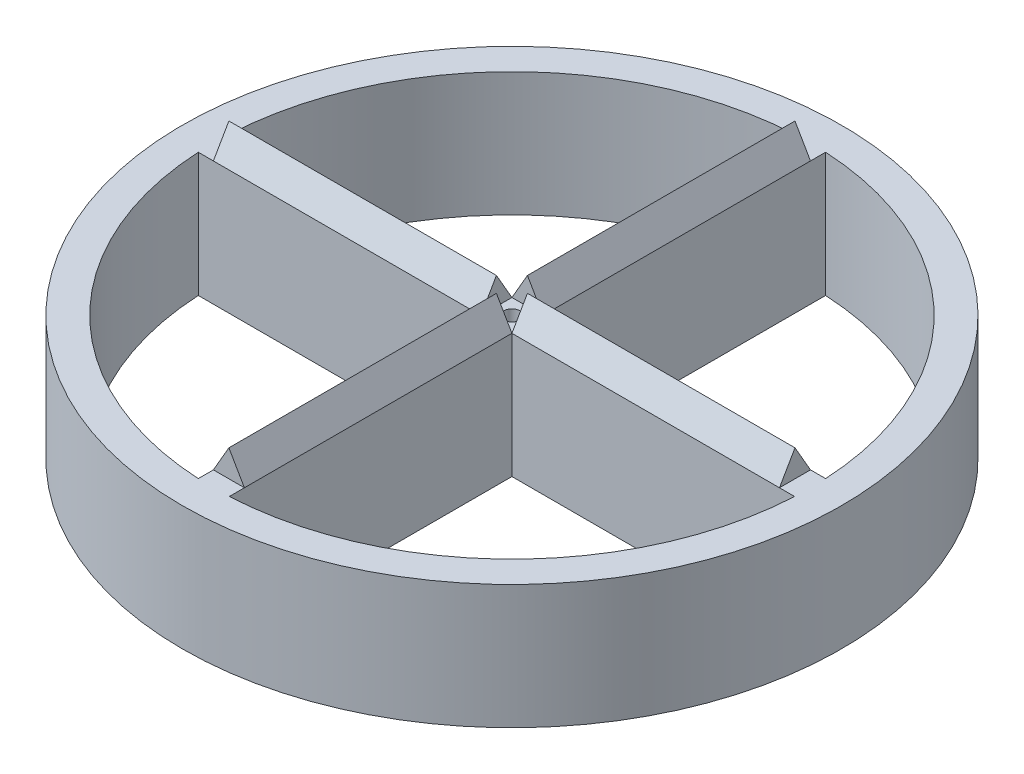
ISO-10303-21;
HEADER;
FILE_DESCRIPTION(('STEP AP214'),'2;1');
FILE_NAME('part.step','',(''),(''),'','','');
FILE_SCHEMA(('AUTOMOTIVE_DESIGN { 1 0 10303 214 1 1 1 1 }'));
ENDSEC;
DATA;
#1=APPLICATION_CONTEXT('core data for automotive mechanical design processes');
#2=APPLICATION_PROTOCOL_DEFINITION('international standard','automotive_design',2000,#1);
#3=PRODUCT_CONTEXT('',#1,'mechanical');
#4=PRODUCT('Part','Part','',(#3));
#5=PRODUCT_RELATED_PRODUCT_CATEGORY('part','',(#4));
#6=PRODUCT_DEFINITION_FORMATION('','',#4);
#7=PRODUCT_DEFINITION_CONTEXT('part definition',#1,'design');
#8=PRODUCT_DEFINITION('design','',#6,#7);
#9=PRODUCT_DEFINITION_SHAPE('','',#8);
#10=(LENGTH_UNIT() NAMED_UNIT(*) SI_UNIT(.MILLI.,.METRE.));
#11=(NAMED_UNIT(*) PLANE_ANGLE_UNIT() SI_UNIT($,.RADIAN.));
#12=(NAMED_UNIT(*) SI_UNIT($,.STERADIAN.) SOLID_ANGLE_UNIT());
#13=UNCERTAINTY_MEASURE_WITH_UNIT(LENGTH_MEASURE(1.E-05),#10,'distance_accuracy_value','');
#14=(GEOMETRIC_REPRESENTATION_CONTEXT(3) GLOBAL_UNCERTAINTY_ASSIGNED_CONTEXT((#13)) GLOBAL_UNIT_ASSIGNED_CONTEXT((#10,
#11,#12)) REPRESENTATION_CONTEXT('',''));
#15=CARTESIAN_POINT('',(0.,0.,0.));
#16=DIRECTION('',(0.,0.,1.));
#17=DIRECTION('',(1.,0.,0.));
#18=AXIS2_PLACEMENT_3D('',#15,#16,#17);
#19=CARTESIAN_POINT('',(-5.,40.,91.25));
#20=DIRECTION('',(-0.866025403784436,0.500000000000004,0.));
#21=DIRECTION('',(-0.500000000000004,-0.866025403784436,0.));
#22=AXIS2_PLACEMENT_3D('',#19,#20,#21);
#23=PLANE('',#22);
#24=DIRECTION('',(-0.500000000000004,-0.866025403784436,0.));
#25=VECTOR('',#24,1.);
#26=CARTESIAN_POINT('',(-5.,40.,-5.));
#27=LINE('',#26,#25);
#28=CARTESIAN_POINT('',(0.,48.6602540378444,-5.));
#29=VERTEX_POINT('',#28);
#30=CARTESIAN_POINT('',(-5.,40.,-5.));
#31=VERTEX_POINT('',#30);
#32=EDGE_CURVE('E176',#29,#31,#27,.T.);
#33=ORIENTED_EDGE('',*,*,#32,.F.);
#34=DIRECTION('',(0.,0.,-1.));
#35=VECTOR('',#34,1.);
#36=CARTESIAN_POINT('',(0.,48.6602540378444,91.25));
#37=LINE('',#36,#35);
#38=CARTESIAN_POINT('',(0.,48.6602540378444,-91.25));
#39=VERTEX_POINT('',#38);
#40=EDGE_CURVE('E200',#29,#39,#37,.T.);
#41=ORIENTED_EDGE('',*,*,#40,.T.);
#42=DIRECTION('',(0.500000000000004,0.866025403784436,0.));
#43=VECTOR('',#42,1.);
#44=CARTESIAN_POINT('',(-5.00000000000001,40.,-91.25));
#45=LINE('',#44,#43);
#46=CARTESIAN_POINT('',(-5.00000000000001,40.,-91.25));
#47=VERTEX_POINT('',#46);
#48=EDGE_CURVE('E352',#47,#39,#45,.T.);
#49=ORIENTED_EDGE('',*,*,#48,.F.);
#50=DIRECTION('',(0.,0.,-1.));
#51=VECTOR('',#50,1.);
#52=CARTESIAN_POINT('',(-5.,40.,-5.));
#53=LINE('',#52,#51);
#54=EDGE_CURVE('E390',#31,#47,#53,.T.);
#55=ORIENTED_EDGE('',*,*,#54,.F.);
#56=EDGE_LOOP('',(#33,#41,#49,#55));
#57=FACE_BOUND('',#56,.T.);
#58=ADVANCED_FACE('F33',(#57),#23,.T.);
#59=CARTESIAN_POINT('',(5.,40.,91.25));
#60=DIRECTION('',(0.86602540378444,0.499999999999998,0.));
#61=DIRECTION('',(-0.499999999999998,0.86602540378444,0.));
#62=AXIS2_PLACEMENT_3D('',#59,#60,#61);
#63=PLANE('',#62);
#64=DIRECTION('',(-0.499999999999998,0.86602540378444,0.));
#65=VECTOR('',#64,1.);
#66=CARTESIAN_POINT('',(4.99999999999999,40.,-5.));
#67=LINE('',#66,#65);
#68=CARTESIAN_POINT('',(5.,40.,-5.));
#69=VERTEX_POINT('',#68);
#70=EDGE_CURVE('E11',#69,#29,#67,.T.);
#71=ORIENTED_EDGE('',*,*,#70,.F.);
#72=DIRECTION('',(0.,0.,-1.));
#73=VECTOR('',#72,1.);
#74=CARTESIAN_POINT('',(5.,40.,91.25));
#75=LINE('',#74,#73);
#76=CARTESIAN_POINT('',(4.99999999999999,40.,-91.25));
#77=VERTEX_POINT('',#76);
#78=EDGE_CURVE('E198',#69,#77,#75,.T.);
#79=ORIENTED_EDGE('',*,*,#78,.T.);
#80=DIRECTION('',(0.499999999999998,-0.86602540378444,0.));
#81=VECTOR('',#80,1.);
#82=CARTESIAN_POINT('',(4.99999999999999,40.,-91.25));
#83=LINE('',#82,#81);
#84=EDGE_CURVE('E348',#39,#77,#83,.T.);
#85=ORIENTED_EDGE('',*,*,#84,.F.);
#86=ORIENTED_EDGE('',*,*,#40,.F.);
#87=EDGE_LOOP('',(#71,#79,#85,#86));
#88=FACE_BOUND('',#87,.T.);
#89=ADVANCED_FACE('F196',(#88),#63,.T.);
#90=CARTESIAN_POINT('',(91.25,40.,-5.));
#91=DIRECTION('',(0.,0.499999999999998,-0.86602540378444));
#92=DIRECTION('',(0.,0.86602540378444,0.499999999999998));
#93=AXIS2_PLACEMENT_3D('',#90,#91,#92);
#94=PLANE('',#93);
#95=DIRECTION('',(-1.,0.,0.));
#96=VECTOR('',#95,1.);
#97=CARTESIAN_POINT('',(91.25,48.6602540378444,0.));
#98=LINE('',#97,#96);
#99=CARTESIAN_POINT('',(-5.,48.6602540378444,0.));
#100=VERTEX_POINT('',#99);
#101=CARTESIAN_POINT('',(-91.25,48.6602540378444,0.));
#102=VERTEX_POINT('',#101);
#103=EDGE_CURVE('E380',#100,#102,#98,.T.);
#104=ORIENTED_EDGE('',*,*,#103,.F.);
#105=DIRECTION('',(0.,-0.86602540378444,-0.499999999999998));
#106=VECTOR('',#105,1.);
#107=CARTESIAN_POINT('',(-5.,40.,-5.));
#108=LINE('',#107,#106);
#109=EDGE_CURVE('E219',#100,#31,#108,.T.);
#110=ORIENTED_EDGE('',*,*,#109,.T.);
#111=DIRECTION('',(1.,0.,0.));
#112=VECTOR('',#111,1.);
#113=CARTESIAN_POINT('',(-5.,40.,-5.));
#114=LINE('',#113,#112);
#115=CARTESIAN_POINT('',(-91.25,40.,-5.));
#116=VERTEX_POINT('',#115);
#117=EDGE_CURVE('E385',#116,#31,#114,.T.);
#118=ORIENTED_EDGE('',*,*,#117,.F.);
#119=DIRECTION('',(0.,-0.86602540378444,-0.499999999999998));
#120=VECTOR('',#119,1.);
#121=CARTESIAN_POINT('',(-91.25,40.,-5.));
#122=LINE('',#121,#120);
#123=EDGE_CURVE('E365',#102,#116,#122,.T.);
#124=ORIENTED_EDGE('',*,*,#123,.F.);
#125=EDGE_LOOP('',(#104,#110,#118,#124));
#126=FACE_BOUND('',#125,.T.);
#127=ADVANCED_FACE('F416',(#126),#94,.T.);
#128=DIRECTION('',(1.,0.,0.));
#129=VECTOR('',#128,1.);
#130=CARTESIAN_POINT('',(5.,40.,-5.));
#131=LINE('',#130,#129);
#132=CARTESIAN_POINT('',(91.25,40.,-5.));
#133=VERTEX_POINT('',#132);
#134=EDGE_CURVE('E223',#69,#133,#131,.T.);
#135=ORIENTED_EDGE('',*,*,#134,.F.);
#136=DIRECTION('',(0.,0.86602540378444,0.499999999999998));
#137=VECTOR('',#136,1.);
#138=CARTESIAN_POINT('',(4.99999999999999,40.,-5.));
#139=LINE('',#138,#137);
#140=CARTESIAN_POINT('',(4.99999999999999,48.6602540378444,0.));
#141=VERTEX_POINT('',#140);
#142=EDGE_CURVE('E213',#69,#141,#139,.T.);
#143=ORIENTED_EDGE('',*,*,#142,.T.);
#144=CARTESIAN_POINT('',(91.25,48.6602540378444,0.));
#145=VERTEX_POINT('',#144);
#146=EDGE_CURVE('E378',#145,#141,#98,.T.);
#147=ORIENTED_EDGE('',*,*,#146,.F.);
#148=DIRECTION('',(0.,-0.86602540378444,-0.499999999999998));
#149=VECTOR('',#148,1.);
#150=CARTESIAN_POINT('',(91.25,40.,-5.));
#151=LINE('',#150,#149);
#152=EDGE_CURVE('E225',#145,#133,#151,.T.);
#153=ORIENTED_EDGE('',*,*,#152,.T.);
#154=EDGE_LOOP('',(#135,#143,#147,#153));
#155=FACE_BOUND('',#154,.T.);
#156=ADVANCED_FACE('F224',(#155),#94,.T.);
#157=CARTESIAN_POINT('',(91.25,40.,5.));
#158=DIRECTION('',(0.,0.500000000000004,0.866025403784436));
#159=DIRECTION('',(0.,-0.866025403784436,0.500000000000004));
#160=AXIS2_PLACEMENT_3D('',#157,#158,#159);
#161=PLANE('',#160);
#162=DIRECTION('',(-1.,0.,0.));
#163=VECTOR('',#162,1.);
#164=CARTESIAN_POINT('',(-5.,40.,5.));
#165=LINE('',#164,#163);
#166=CARTESIAN_POINT('',(-5.,40.,5.00000000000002));
#167=VERTEX_POINT('',#166);
#168=CARTESIAN_POINT('',(-91.25,40.,5.00000000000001));
#169=VERTEX_POINT('',#168);
#170=EDGE_CURVE('E251',#167,#169,#165,.T.);
#171=ORIENTED_EDGE('',*,*,#170,.F.);
#172=DIRECTION('',(0.,0.866025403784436,-0.500000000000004));
#173=VECTOR('',#172,1.);
#174=CARTESIAN_POINT('',(-5.,40.,5.00000000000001));
#175=LINE('',#174,#173);
#176=EDGE_CURVE('E276',#167,#100,#175,.T.);
#177=ORIENTED_EDGE('',*,*,#176,.T.);
#178=ORIENTED_EDGE('',*,*,#103,.T.);
#179=DIRECTION('',(0.,0.866025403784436,-0.500000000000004));
#180=VECTOR('',#179,1.);
#181=CARTESIAN_POINT('',(-91.25,40.,5.00000000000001));
#182=LINE('',#181,#180);
#183=EDGE_CURVE('E370',#169,#102,#182,.T.);
#184=ORIENTED_EDGE('',*,*,#183,.F.);
#185=EDGE_LOOP('',(#171,#177,#178,#184));
#186=FACE_BOUND('',#185,.T.);
#187=ADVANCED_FACE('F422',(#186),#161,.T.);
#188=ORIENTED_EDGE('',*,*,#146,.T.);
#189=DIRECTION('',(0.,-0.866025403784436,0.500000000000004));
#190=VECTOR('',#189,1.);
#191=CARTESIAN_POINT('',(4.99999999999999,40.,5.));
#192=LINE('',#191,#190);
#193=CARTESIAN_POINT('',(5.,40.,5.));
#194=VERTEX_POINT('',#193);
#195=EDGE_CURVE('E216',#141,#194,#192,.T.);
#196=ORIENTED_EDGE('',*,*,#195,.T.);
#197=DIRECTION('',(-1.,0.,0.));
#198=VECTOR('',#197,1.);
#199=CARTESIAN_POINT('',(91.25,40.,5.));
#200=LINE('',#199,#198);
#201=CARTESIAN_POINT('',(91.25,40.,5.));
#202=VERTEX_POINT('',#201);
#203=EDGE_CURVE('E377',#202,#194,#200,.T.);
#204=ORIENTED_EDGE('',*,*,#203,.F.);
#205=DIRECTION('',(0.,0.866025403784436,-0.500000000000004));
#206=VECTOR('',#205,1.);
#207=CARTESIAN_POINT('',(91.25,40.,5.));
#208=LINE('',#207,#206);
#209=EDGE_CURVE('E48',#202,#145,#208,.T.);
#210=ORIENTED_EDGE('',*,*,#209,.T.);
#211=EDGE_LOOP('',(#188,#196,#204,#210));
#212=FACE_BOUND('',#211,.T.);
#213=ADVANCED_FACE('F470',(#212),#161,.T.);
#214=CARTESIAN_POINT('',(0.,40.,0.));
#215=DIRECTION('',(0.,1.,0.));
#216=DIRECTION('',(0.,0.,1.));
#217=AXIS2_PLACEMENT_3D('',#214,#215,#216);
#218=PLANE('',#217);
#219=DIRECTION('',(-1.,0.,0.));
#220=VECTOR('',#219,1.);
#221=CARTESIAN_POINT('',(-5.,40.,91.25));
#222=LINE('',#221,#220);
#223=CARTESIAN_POINT('',(5.,40.,91.25));
#224=VERTEX_POINT('',#223);
#225=CARTESIAN_POINT('',(-5.,40.,91.25));
#226=VERTEX_POINT('',#225);
#227=EDGE_CURVE('E357',#224,#226,#222,.T.);
#228=ORIENTED_EDGE('',*,*,#227,.T.);
#229=DIRECTION('',(0.,0.,-1.));
#230=VECTOR('',#229,1.);
#231=CARTESIAN_POINT('',(-5.,40.,5.));
#232=LINE('',#231,#230);
#233=CARTESIAN_POINT('',(-5.,40.,96.1200421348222));
#234=VERTEX_POINT('',#233);
#235=EDGE_CURVE('E246',#234,#226,#232,.T.);
#236=ORIENTED_EDGE('',*,*,#235,.F.);
#237=CARTESIAN_POINT('',(0.,40.,0.));
#238=DIRECTION('',(0.,1.,0.));
#239=DIRECTION('',(0.,0.,1.));
#240=AXIS2_PLACEMENT_3D('',#237,#238,#239);
#241=CIRCLE('',#240,96.25);
#242=CARTESIAN_POINT('',(-96.1200421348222,40.,5.));
#243=VERTEX_POINT('',#242);
#244=EDGE_CURVE('E244',#243,#234,#241,.T.);
#245=ORIENTED_EDGE('',*,*,#244,.F.);
#246=EDGE_CURVE('E250',#169,#243,#165,.T.);
#247=ORIENTED_EDGE('',*,*,#246,.F.);
#248=DIRECTION('',(0.,0.,1.));
#249=VECTOR('',#248,1.);
#250=CARTESIAN_POINT('',(-91.25,40.,-5.));
#251=LINE('',#250,#249);
#252=EDGE_CURVE('E368',#116,#169,#251,.T.);
#253=ORIENTED_EDGE('',*,*,#252,.F.);
#254=CARTESIAN_POINT('',(-96.1200421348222,40.,-5.));
#255=VERTEX_POINT('',#254);
#256=EDGE_CURVE('E387',#255,#116,#114,.T.);
#257=ORIENTED_EDGE('',*,*,#256,.F.);
#258=CARTESIAN_POINT('',(0.,40.,0.));
#259=DIRECTION('',(0.,1.,0.));
#260=DIRECTION('',(0.,0.,1.));
#261=AXIS2_PLACEMENT_3D('',#258,#259,#260);
#262=CIRCLE('',#261,96.25);
#263=CARTESIAN_POINT('',(-5.,40.,-96.1200421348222));
#264=VERTEX_POINT('',#263);
#265=EDGE_CURVE('E383',#264,#255,#262,.T.);
#266=ORIENTED_EDGE('',*,*,#265,.F.);
#267=EDGE_CURVE('E342',#47,#264,#53,.T.);
#268=ORIENTED_EDGE('',*,*,#267,.F.);
#269=DIRECTION('',(-1.,0.,0.));
#270=VECTOR('',#269,1.);
#271=CARTESIAN_POINT('',(-5.00000000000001,40.,-91.25));
#272=LINE('',#271,#270);
#273=EDGE_CURVE('E340',#77,#47,#272,.T.);
#274=ORIENTED_EDGE('',*,*,#273,.F.);
#275=DIRECTION('',(0.,0.,1.));
#276=VECTOR('',#275,1.);
#277=CARTESIAN_POINT('',(5.,40.,-5.));
#278=LINE('',#277,#276);
#279=CARTESIAN_POINT('',(5.,40.,-96.1200421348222));
#280=VERTEX_POINT('',#279);
#281=EDGE_CURVE('E209',#280,#77,#278,.T.);
#282=ORIENTED_EDGE('',*,*,#281,.F.);
#283=CARTESIAN_POINT('',(0.,40.,0.));
#284=DIRECTION('',(0.,1.,0.));
#285=DIRECTION('',(0.,0.,1.));
#286=AXIS2_PLACEMENT_3D('',#283,#284,#285);
#287=CIRCLE('',#286,96.25);
#288=CARTESIAN_POINT('',(96.1200421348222,40.,-5.));
#289=VERTEX_POINT('',#288);
#290=EDGE_CURVE('E320',#289,#280,#287,.T.);
#291=ORIENTED_EDGE('',*,*,#290,.F.);
#292=EDGE_CURVE('E229',#133,#289,#131,.T.);
#293=ORIENTED_EDGE('',*,*,#292,.F.);
#294=DIRECTION('',(0.,0.,1.));
#295=VECTOR('',#294,1.);
#296=CARTESIAN_POINT('',(91.25,40.,-5.));
#297=LINE('',#296,#295);
#298=EDGE_CURVE('E374',#133,#202,#297,.T.);
#299=ORIENTED_EDGE('',*,*,#298,.T.);
#300=DIRECTION('',(-1.,0.,0.));
#301=VECTOR('',#300,1.);
#302=CARTESIAN_POINT('',(5.,40.,5.));
#303=LINE('',#302,#301);
#304=CARTESIAN_POINT('',(96.1200421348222,40.,5.));
#305=VERTEX_POINT('',#304);
#306=EDGE_CURVE('E298',#305,#202,#303,.T.);
#307=ORIENTED_EDGE('',*,*,#306,.F.);
#308=CARTESIAN_POINT('',(0.,40.,0.));
#309=DIRECTION('',(0.,1.,0.));
#310=DIRECTION('',(0.,0.,1.));
#311=AXIS2_PLACEMENT_3D('',#308,#309,#310);
#312=CIRCLE('',#311,96.25);
#313=CARTESIAN_POINT('',(5.,40.,96.1200421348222));
#314=VERTEX_POINT('',#313);
#315=EDGE_CURVE('E293',#314,#305,#312,.T.);
#316=ORIENTED_EDGE('',*,*,#315,.F.);
#317=DIRECTION('',(0.,0.,1.));
#318=VECTOR('',#317,1.);
#319=CARTESIAN_POINT('',(5.,40.,5.));
#320=LINE('',#319,#318);
#321=EDGE_CURVE('E294',#224,#314,#320,.T.);
#322=ORIENTED_EDGE('',*,*,#321,.F.);
#323=EDGE_LOOP('',(#228,#236,#245,#247,#253,#257,#266,#268,#274,#282,#291,#293,#299,#307,#316,#322));
#324=FACE_BOUND('',#323,.T.);
#325=CARTESIAN_POINT('',(0.,40.,0.));
#326=DIRECTION('',(0.,1.,0.));
#327=DIRECTION('',(0.,0.,1.));
#328=AXIS2_PLACEMENT_3D('',#325,#326,#327);
#329=CIRCLE('',#328,106.25);
#330=CARTESIAN_POINT('',(0.,40.,106.25));
#331=VERTEX_POINT('',#330);
#332=EDGE_CURVE('E270',#331,#331,#329,.T.);
#333=ORIENTED_EDGE('',*,*,#332,.T.);
#334=EDGE_LOOP('',(#333));
#335=FACE_BOUND('',#334,.T.);
#336=ADVANCED_FACE('F335',(#324,#335),#218,.T.);
#337=CARTESIAN_POINT('',(0.,0.,0.));
#338=DIRECTION('',(0.,1.,0.));
#339=DIRECTION('',(0.,0.,1.));
#340=AXIS2_PLACEMENT_3D('',#337,#338,#339);
#341=PLANE('',#340);
#342=CARTESIAN_POINT('',(0.,0.,0.));
#343=DIRECTION('',(0.,1.,0.));
#344=DIRECTION('',(0.,0.,1.));
#345=AXIS2_PLACEMENT_3D('',#342,#343,#344);
#346=CIRCLE('',#345,2.6);
#347=CARTESIAN_POINT('',(0.,0.,2.6));
#348=VERTEX_POINT('',#347);
#349=EDGE_CURVE('E514',#348,#348,#346,.T.);
#350=ORIENTED_EDGE('',*,*,#349,.T.);
#351=EDGE_LOOP('',(#350));
#352=FACE_BOUND('',#351,.T.);
#353=DIRECTION('',(-1.,0.,0.));
#354=VECTOR('',#353,1.);
#355=CARTESIAN_POINT('',(5.,0.,5.));
#356=LINE('',#355,#354);
#357=CARTESIAN_POINT('',(96.1200421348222,0.,5.));
#358=VERTEX_POINT('',#357);
#359=CARTESIAN_POINT('',(5.,0.,5.));
#360=VERTEX_POINT('',#359);
#361=EDGE_CURVE('E302',#358,#360,#356,.T.);
#362=ORIENTED_EDGE('',*,*,#361,.T.);
#363=DIRECTION('',(0.,0.,1.));
#364=VECTOR('',#363,1.);
#365=CARTESIAN_POINT('',(5.,0.,5.));
#366=LINE('',#365,#364);
#367=CARTESIAN_POINT('',(5.,0.,96.1200421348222));
#368=VERTEX_POINT('',#367);
#369=EDGE_CURVE('E305',#360,#368,#366,.T.);
#370=ORIENTED_EDGE('',*,*,#369,.T.);
#371=CARTESIAN_POINT('',(0.,0.,0.));
#372=DIRECTION('',(0.,1.,0.));
#373=DIRECTION('',(0.,0.,1.));
#374=AXIS2_PLACEMENT_3D('',#371,#372,#373);
#375=CIRCLE('',#374,96.25);
#376=EDGE_CURVE('E309',#368,#358,#375,.T.);
#377=ORIENTED_EDGE('',*,*,#376,.T.);
#378=EDGE_LOOP('',(#362,#370,#377));
#379=FACE_BOUND('',#378,.T.);
#380=CARTESIAN_POINT('',(0.,0.,0.));
#381=DIRECTION('',(0.,1.,0.));
#382=DIRECTION('',(0.,0.,1.));
#383=AXIS2_PLACEMENT_3D('',#380,#381,#382);
#384=CIRCLE('',#383,96.25);
#385=CARTESIAN_POINT('',(-96.1200421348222,0.,5.));
#386=VERTEX_POINT('',#385);
#387=CARTESIAN_POINT('',(-5.,0.,96.1200421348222));
#388=VERTEX_POINT('',#387);
#389=EDGE_CURVE('E239',#386,#388,#384,.T.);
#390=ORIENTED_EDGE('',*,*,#389,.T.);
#391=DIRECTION('',(0.,0.,-1.));
#392=VECTOR('',#391,1.);
#393=CARTESIAN_POINT('',(-5.,0.,5.));
#394=LINE('',#393,#392);
#395=CARTESIAN_POINT('',(-5.,0.,5.));
#396=VERTEX_POINT('',#395);
#397=EDGE_CURVE('E257',#388,#396,#394,.T.);
#398=ORIENTED_EDGE('',*,*,#397,.T.);
#399=DIRECTION('',(-1.,0.,0.));
#400=VECTOR('',#399,1.);
#401=CARTESIAN_POINT('',(-5.,0.,5.));
#402=LINE('',#401,#400);
#403=EDGE_CURVE('E247',#396,#386,#402,.T.);
#404=ORIENTED_EDGE('',*,*,#403,.T.);
#405=EDGE_LOOP('',(#390,#398,#404));
#406=FACE_BOUND('',#405,.T.);
#407=CARTESIAN_POINT('',(0.,0.,0.));
#408=DIRECTION('',(0.,1.,0.));
#409=DIRECTION('',(0.,0.,1.));
#410=AXIS2_PLACEMENT_3D('',#407,#408,#409);
#411=CIRCLE('',#410,106.25);
#412=CARTESIAN_POINT('',(0.,0.,106.25));
#413=VERTEX_POINT('',#412);
#414=EDGE_CURVE('E269',#413,#413,#411,.T.);
#415=ORIENTED_EDGE('',*,*,#414,.F.);
#416=EDGE_LOOP('',(#415));
#417=FACE_BOUND('',#416,.T.);
#418=CARTESIAN_POINT('',(0.,0.,0.));
#419=DIRECTION('',(0.,1.,0.));
#420=DIRECTION('',(0.,0.,1.));
#421=AXIS2_PLACEMENT_3D('',#418,#419,#420);
#422=CIRCLE('',#421,96.25);
#423=CARTESIAN_POINT('',(96.1200421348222,0.,-5.));
#424=VERTEX_POINT('',#423);
#425=CARTESIAN_POINT('',(5.,0.,-96.1200421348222));
#426=VERTEX_POINT('',#425);
#427=EDGE_CURVE('E319',#424,#426,#422,.T.);
#428=ORIENTED_EDGE('',*,*,#427,.T.);
#429=DIRECTION('',(0.,0.,1.));
#430=VECTOR('',#429,1.);
#431=CARTESIAN_POINT('',(5.,0.,-5.));
#432=LINE('',#431,#430);
#433=CARTESIAN_POINT('',(5.,0.,-5.));
#434=VERTEX_POINT('',#433);
#435=EDGE_CURVE('E325',#426,#434,#432,.T.);
#436=ORIENTED_EDGE('',*,*,#435,.T.);
#437=DIRECTION('',(1.,0.,0.));
#438=VECTOR('',#437,1.);
#439=CARTESIAN_POINT('',(5.,0.,-5.));
#440=LINE('',#439,#438);
#441=EDGE_CURVE('E234',#434,#424,#440,.T.);
#442=ORIENTED_EDGE('',*,*,#441,.T.);
#443=EDGE_LOOP('',(#428,#436,#442));
#444=FACE_BOUND('',#443,.T.);
#445=CARTESIAN_POINT('',(0.,0.,0.));
#446=DIRECTION('',(0.,1.,0.));
#447=DIRECTION('',(0.,0.,1.));
#448=AXIS2_PLACEMENT_3D('',#445,#446,#447);
#449=CIRCLE('',#448,96.25);
#450=CARTESIAN_POINT('',(-5.,0.,-96.1200421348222));
#451=VERTEX_POINT('',#450);
#452=CARTESIAN_POINT('',(-96.1200421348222,0.,-5.));
#453=VERTEX_POINT('',#452);
#454=EDGE_CURVE('E56',#451,#453,#449,.T.);
#455=ORIENTED_EDGE('',*,*,#454,.T.);
#456=DIRECTION('',(1.,0.,0.));
#457=VECTOR('',#456,1.);
#458=CARTESIAN_POINT('',(-5.,0.,-5.));
#459=LINE('',#458,#457);
#460=CARTESIAN_POINT('',(-5.,0.,-5.));
#461=VERTEX_POINT('',#460);
#462=EDGE_CURVE('E394',#453,#461,#459,.T.);
#463=ORIENTED_EDGE('',*,*,#462,.T.);
#464=DIRECTION('',(0.,0.,-1.));
#465=VECTOR('',#464,1.);
#466=CARTESIAN_POINT('',(-5.,0.,-5.));
#467=LINE('',#466,#465);
#468=EDGE_CURVE('E386',#461,#451,#467,.T.);
#469=ORIENTED_EDGE('',*,*,#468,.T.);
#470=EDGE_LOOP('',(#455,#463,#469));
#471=FACE_BOUND('',#470,.T.);
#472=ADVANCED_FACE('F327',(#352,#379,#406,#417,#444,#471),#341,.F.);
#473=CARTESIAN_POINT('',(0.,40.,0.));
#474=DIRECTION('',(0.,-1.,0.));
#475=DIRECTION('',(0.,0.,-1.));
#476=AXIS2_PLACEMENT_3D('',#473,#474,#475);
#477=CYLINDRICAL_SURFACE('',#476,106.25);
#478=ORIENTED_EDGE('',*,*,#332,.F.);
#479=EDGE_LOOP('',(#478));
#480=FACE_BOUND('',#479,.T.);
#481=ORIENTED_EDGE('',*,*,#414,.T.);
#482=EDGE_LOOP('',(#481));
#483=FACE_BOUND('',#482,.T.);
#484=ADVANCED_FACE('F35',(#480,#483),#477,.T.);
#485=CARTESIAN_POINT('',(0.,40.,0.));
#486=DIRECTION('',(0.,-1.,0.));
#487=DIRECTION('',(0.,0.,-1.));
#488=AXIS2_PLACEMENT_3D('',#485,#486,#487);
#489=CYLINDRICAL_SURFACE('',#488,96.25);
#490=ORIENTED_EDGE('',*,*,#389,.F.);
#491=DIRECTION('',(0.,-1.,0.));
#492=VECTOR('',#491,1.);
#493=CARTESIAN_POINT('',(-96.1200421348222,40.,5.));
#494=LINE('',#493,#492);
#495=EDGE_CURVE('E254',#243,#386,#494,.T.);
#496=ORIENTED_EDGE('',*,*,#495,.F.);
#497=ORIENTED_EDGE('',*,*,#244,.T.);
#498=DIRECTION('',(0.,-1.,0.));
#499=VECTOR('',#498,1.);
#500=CARTESIAN_POINT('',(-5.,40.,96.1200421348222));
#501=LINE('',#500,#499);
#502=EDGE_CURVE('E266',#234,#388,#501,.T.);
#503=ORIENTED_EDGE('',*,*,#502,.T.);
#504=EDGE_LOOP('',(#490,#496,#497,#503));
#505=FACE_BOUND('',#504,.T.);
#506=ADVANCED_FACE('F500',(#505),#489,.F.);
#507=CARTESIAN_POINT('',(-5.,40.,5.));
#508=DIRECTION('',(-1.,0.,0.));
#509=DIRECTION('',(0.,0.,1.));
#510=AXIS2_PLACEMENT_3D('',#507,#508,#509);
#511=PLANE('',#510);
#512=ORIENTED_EDGE('',*,*,#397,.F.);
#513=ORIENTED_EDGE('',*,*,#502,.F.);
#514=ORIENTED_EDGE('',*,*,#235,.T.);
#515=DIRECTION('',(0.,0.,-1.));
#516=VECTOR('',#515,1.);
#517=CARTESIAN_POINT('',(-5.,40.,91.25));
#518=LINE('',#517,#516);
#519=EDGE_CURVE('E191',#226,#167,#518,.T.);
#520=ORIENTED_EDGE('',*,*,#519,.T.);
#521=DIRECTION('',(0.,-1.,0.));
#522=VECTOR('',#521,1.);
#523=CARTESIAN_POINT('',(-5.,40.,5.));
#524=LINE('',#523,#522);
#525=EDGE_CURVE('E264',#167,#396,#524,.T.);
#526=ORIENTED_EDGE('',*,*,#525,.T.);
#527=EDGE_LOOP('',(#512,#513,#514,#520,#526));
#528=FACE_BOUND('',#527,.T.);
#529=ADVANCED_FACE('F431',(#528),#511,.T.);
#530=CARTESIAN_POINT('',(-5.,40.,5.));
#531=DIRECTION('',(0.,0.,1.));
#532=DIRECTION('',(1.,0.,0.));
#533=AXIS2_PLACEMENT_3D('',#530,#531,#532);
#534=PLANE('',#533);
#535=ORIENTED_EDGE('',*,*,#403,.F.);
#536=ORIENTED_EDGE('',*,*,#525,.F.);
#537=ORIENTED_EDGE('',*,*,#170,.T.);
#538=ORIENTED_EDGE('',*,*,#246,.T.);
#539=ORIENTED_EDGE('',*,*,#495,.T.);
#540=EDGE_LOOP('',(#535,#536,#537,#538,#539));
#541=FACE_BOUND('',#540,.T.);
#542=ADVANCED_FACE('F429',(#541),#534,.T.);
#543=CARTESIAN_POINT('',(0.,40.,0.));
#544=DIRECTION('',(0.,-1.,0.));
#545=DIRECTION('',(0.,0.,-1.));
#546=AXIS2_PLACEMENT_3D('',#543,#544,#545);
#547=CYLINDRICAL_SURFACE('',#546,96.25);
#548=ORIENTED_EDGE('',*,*,#427,.F.);
#549=DIRECTION('',(0.,-1.,0.));
#550=VECTOR('',#549,1.);
#551=CARTESIAN_POINT('',(96.1200421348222,40.,-5.));
#552=LINE('',#551,#550);
#553=EDGE_CURVE('E228',#289,#424,#552,.T.);
#554=ORIENTED_EDGE('',*,*,#553,.F.);
#555=ORIENTED_EDGE('',*,*,#290,.T.);
#556=DIRECTION('',(0.,-1.,0.));
#557=VECTOR('',#556,1.);
#558=CARTESIAN_POINT('',(5.,40.,-96.1200421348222));
#559=LINE('',#558,#557);
#560=EDGE_CURVE('E236',#280,#426,#559,.T.);
#561=ORIENTED_EDGE('',*,*,#560,.T.);
#562=EDGE_LOOP('',(#548,#554,#555,#561));
#563=FACE_BOUND('',#562,.T.);
#564=ADVANCED_FACE('F330',(#563),#547,.F.);
#565=CARTESIAN_POINT('',(5.,40.,-5.));
#566=DIRECTION('',(1.,0.,0.));
#567=DIRECTION('',(0.,0.,-1.));
#568=AXIS2_PLACEMENT_3D('',#565,#566,#567);
#569=PLANE('',#568);
#570=ORIENTED_EDGE('',*,*,#435,.F.);
#571=ORIENTED_EDGE('',*,*,#560,.F.);
#572=ORIENTED_EDGE('',*,*,#281,.T.);
#573=ORIENTED_EDGE('',*,*,#78,.F.);
#574=DIRECTION('',(0.,-1.,0.));
#575=VECTOR('',#574,1.);
#576=CARTESIAN_POINT('',(5.,40.,-5.));
#577=LINE('',#576,#575);
#578=EDGE_CURVE('E205',#69,#434,#577,.T.);
#579=ORIENTED_EDGE('',*,*,#578,.T.);
#580=EDGE_LOOP('',(#570,#571,#572,#573,#579));
#581=FACE_BOUND('',#580,.T.);
#582=ADVANCED_FACE('F203',(#581),#569,.T.);
#583=CARTESIAN_POINT('',(5.,40.,-5.));
#584=DIRECTION('',(0.,0.,-1.));
#585=DIRECTION('',(-1.,0.,0.));
#586=AXIS2_PLACEMENT_3D('',#583,#584,#585);
#587=PLANE('',#586);
#588=ORIENTED_EDGE('',*,*,#441,.F.);
#589=ORIENTED_EDGE('',*,*,#578,.F.);
#590=ORIENTED_EDGE('',*,*,#134,.T.);
#591=ORIENTED_EDGE('',*,*,#292,.T.);
#592=ORIENTED_EDGE('',*,*,#553,.T.);
#593=EDGE_LOOP('',(#588,#589,#590,#591,#592));
#594=FACE_BOUND('',#593,.T.);
#595=ADVANCED_FACE('F231',(#594),#587,.T.);
#596=CARTESIAN_POINT('',(5.,40.,5.));
#597=DIRECTION('',(0.,0.,1.));
#598=DIRECTION('',(1.,0.,0.));
#599=AXIS2_PLACEMENT_3D('',#596,#597,#598);
#600=PLANE('',#599);
#601=ORIENTED_EDGE('',*,*,#361,.F.);
#602=DIRECTION('',(0.,-1.,0.));
#603=VECTOR('',#602,1.);
#604=CARTESIAN_POINT('',(96.1200421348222,40.,5.));
#605=LINE('',#604,#603);
#606=EDGE_CURVE('E296',#305,#358,#605,.T.);
#607=ORIENTED_EDGE('',*,*,#606,.F.);
#608=ORIENTED_EDGE('',*,*,#306,.T.);
#609=ORIENTED_EDGE('',*,*,#203,.T.);
#610=DIRECTION('',(0.,-1.,0.));
#611=VECTOR('',#610,1.);
#612=CARTESIAN_POINT('',(5.,40.,5.));
#613=LINE('',#612,#611);
#614=EDGE_CURVE('E316',#194,#360,#613,.T.);
#615=ORIENTED_EDGE('',*,*,#614,.T.);
#616=EDGE_LOOP('',(#601,#607,#608,#609,#615));
#617=FACE_BOUND('',#616,.T.);
#618=ADVANCED_FACE('F486',(#617),#600,.T.);
#619=CARTESIAN_POINT('',(5.,40.,5.));
#620=DIRECTION('',(1.,0.,0.));
#621=DIRECTION('',(0.,0.,-1.));
#622=AXIS2_PLACEMENT_3D('',#619,#620,#621);
#623=PLANE('',#622);
#624=ORIENTED_EDGE('',*,*,#369,.F.);
#625=ORIENTED_EDGE('',*,*,#614,.F.);
#626=EDGE_CURVE('E286',#194,#224,#320,.T.);
#627=ORIENTED_EDGE('',*,*,#626,.T.);
#628=ORIENTED_EDGE('',*,*,#321,.T.);
#629=DIRECTION('',(0.,-1.,0.));
#630=VECTOR('',#629,1.);
#631=CARTESIAN_POINT('',(5.,40.,96.1200421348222));
#632=LINE('',#631,#630);
#633=EDGE_CURVE('E314',#314,#368,#632,.T.);
#634=ORIENTED_EDGE('',*,*,#633,.T.);
#635=EDGE_LOOP('',(#624,#625,#627,#628,#634));
#636=FACE_BOUND('',#635,.T.);
#637=ADVANCED_FACE('F482',(#636),#623,.T.);
#638=CARTESIAN_POINT('',(0.,40.,0.));
#639=DIRECTION('',(0.,-1.,0.));
#640=DIRECTION('',(0.,0.,-1.));
#641=AXIS2_PLACEMENT_3D('',#638,#639,#640);
#642=CYLINDRICAL_SURFACE('',#641,96.25);
#643=ORIENTED_EDGE('',*,*,#376,.F.);
#644=ORIENTED_EDGE('',*,*,#633,.F.);
#645=ORIENTED_EDGE('',*,*,#315,.T.);
#646=ORIENTED_EDGE('',*,*,#606,.T.);
#647=EDGE_LOOP('',(#643,#644,#645,#646));
#648=FACE_BOUND('',#647,.T.);
#649=ADVANCED_FACE('F479',(#648),#642,.F.);
#650=CARTESIAN_POINT('',(0.,40.,0.));
#651=DIRECTION('',(0.,-1.,0.));
#652=DIRECTION('',(0.,0.,-1.));
#653=AXIS2_PLACEMENT_3D('',#650,#651,#652);
#654=CYLINDRICAL_SURFACE('',#653,96.25);
#655=ORIENTED_EDGE('',*,*,#454,.F.);
#656=DIRECTION('',(0.,-1.,0.));
#657=VECTOR('',#656,1.);
#658=CARTESIAN_POINT('',(-5.,40.,-96.1200421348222));
#659=LINE('',#658,#657);
#660=EDGE_CURVE('E392',#264,#451,#659,.T.);
#661=ORIENTED_EDGE('',*,*,#660,.F.);
#662=ORIENTED_EDGE('',*,*,#265,.T.);
#663=DIRECTION('',(0.,-1.,0.));
#664=VECTOR('',#663,1.);
#665=CARTESIAN_POINT('',(-96.1200421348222,40.,-5.));
#666=LINE('',#665,#664);
#667=EDGE_CURVE('E306',#255,#453,#666,.T.);
#668=ORIENTED_EDGE('',*,*,#667,.T.);
#669=EDGE_LOOP('',(#655,#661,#662,#668));
#670=FACE_BOUND('',#669,.T.);
#671=ADVANCED_FACE('F402',(#670),#654,.F.);
#672=CARTESIAN_POINT('',(-5.,40.,-5.));
#673=DIRECTION('',(0.,0.,-1.));
#674=DIRECTION('',(-1.,0.,0.));
#675=AXIS2_PLACEMENT_3D('',#672,#673,#674);
#676=PLANE('',#675);
#677=ORIENTED_EDGE('',*,*,#462,.F.);
#678=ORIENTED_EDGE('',*,*,#667,.F.);
#679=ORIENTED_EDGE('',*,*,#256,.T.);
#680=ORIENTED_EDGE('',*,*,#117,.T.);
#681=DIRECTION('',(0.,-1.,0.));
#682=VECTOR('',#681,1.);
#683=CARTESIAN_POINT('',(-5.,40.,-5.));
#684=LINE('',#683,#682);
#685=EDGE_CURVE('E400',#31,#461,#684,.T.);
#686=ORIENTED_EDGE('',*,*,#685,.T.);
#687=EDGE_LOOP('',(#677,#678,#679,#680,#686));
#688=FACE_BOUND('',#687,.T.);
#689=ADVANCED_FACE('F412',(#688),#676,.T.);
#690=CARTESIAN_POINT('',(-5.,40.,-5.));
#691=DIRECTION('',(-1.,0.,0.));
#692=DIRECTION('',(0.,0.,1.));
#693=AXIS2_PLACEMENT_3D('',#690,#691,#692);
#694=PLANE('',#693);
#695=ORIENTED_EDGE('',*,*,#468,.F.);
#696=ORIENTED_EDGE('',*,*,#685,.F.);
#697=ORIENTED_EDGE('',*,*,#54,.T.);
#698=ORIENTED_EDGE('',*,*,#267,.T.);
#699=ORIENTED_EDGE('',*,*,#660,.T.);
#700=EDGE_LOOP('',(#695,#696,#697,#698,#699));
#701=FACE_BOUND('',#700,.T.);
#702=ADVANCED_FACE('F408',(#701),#694,.T.);
#703=CARTESIAN_POINT('',(91.25,0.,0.));
#704=DIRECTION('',(-1.,0.,0.));
#705=DIRECTION('',(0.,0.,1.));
#706=AXIS2_PLACEMENT_3D('',#703,#704,#705);
#707=PLANE('',#706);
#708=ORIENTED_EDGE('',*,*,#152,.F.);
#709=ORIENTED_EDGE('',*,*,#209,.F.);
#710=ORIENTED_EDGE('',*,*,#298,.F.);
#711=EDGE_LOOP('',(#708,#709,#710));
#712=FACE_BOUND('',#711,.T.);
#713=ADVANCED_FACE('F465',(#712),#707,.F.);
#714=CARTESIAN_POINT('',(-91.25,0.,0.));
#715=DIRECTION('',(-1.,0.,0.));
#716=DIRECTION('',(0.,0.,1.));
#717=AXIS2_PLACEMENT_3D('',#714,#715,#716);
#718=PLANE('',#717);
#719=ORIENTED_EDGE('',*,*,#123,.T.);
#720=ORIENTED_EDGE('',*,*,#252,.T.);
#721=ORIENTED_EDGE('',*,*,#183,.T.);
#722=EDGE_LOOP('',(#719,#720,#721));
#723=FACE_BOUND('',#722,.T.);
#724=ADVANCED_FACE('F418',(#723),#718,.T.);
#725=CARTESIAN_POINT('',(-5.00000000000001,57.6602089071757,-101.25));
#726=DIRECTION('',(1.,0.,0.));
#727=DIRECTION('',(0.,0.,-1.));
#728=AXIS2_PLACEMENT_3D('',#725,#726,#727);
#729=PLANE('',#728);
#730=ORIENTED_EDGE('',*,*,#176,.F.);
#731=DIRECTION('',(0.,0.,1.));
#732=VECTOR('',#731,1.);
#733=CARTESIAN_POINT('',(-5.00000000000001,40.,-101.25));
#734=LINE('',#733,#732);
#735=EDGE_CURVE('E190',#31,#167,#734,.T.);
#736=ORIENTED_EDGE('',*,*,#735,.F.);
#737=ORIENTED_EDGE('',*,*,#109,.F.);
#738=EDGE_LOOP('',(#730,#736,#737));
#739=FACE_BOUND('',#738,.T.);
#740=ADVANCED_FACE('F438',(#739),#729,.T.);
#741=CARTESIAN_POINT('',(4.99999999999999,57.6602089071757,-101.25));
#742=DIRECTION('',(-1.,0.,0.));
#743=DIRECTION('',(0.,-1.,0.));
#744=AXIS2_PLACEMENT_3D('',#741,#742,#743);
#745=PLANE('',#744);
#746=DIRECTION('',(0.,0.,1.));
#747=VECTOR('',#746,1.);
#748=CARTESIAN_POINT('',(4.99999999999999,40.,-101.25));
#749=LINE('',#748,#747);
#750=EDGE_CURVE('E184',#69,#194,#749,.T.);
#751=ORIENTED_EDGE('',*,*,#750,.T.);
#752=ORIENTED_EDGE('',*,*,#195,.F.);
#753=ORIENTED_EDGE('',*,*,#142,.F.);
#754=EDGE_LOOP('',(#751,#752,#753));
#755=FACE_BOUND('',#754,.T.);
#756=ADVANCED_FACE('F215',(#755),#745,.T.);
#757=DIRECTION('',(0.500000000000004,0.866025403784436,0.));
#758=VECTOR('',#757,1.);
#759=CARTESIAN_POINT('',(-5.00000000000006,39.9999999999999,5.00000000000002));
#760=LINE('',#759,#758);
#761=CARTESIAN_POINT('',(0.,48.6602540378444,5.00000000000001));
#762=VERTEX_POINT('',#761);
#763=EDGE_CURVE('E180',#167,#762,#760,.T.);
#764=ORIENTED_EDGE('',*,*,#763,.F.);
#765=ORIENTED_EDGE('',*,*,#519,.F.);
#766=DIRECTION('',(0.500000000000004,0.866025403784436,0.));
#767=VECTOR('',#766,1.);
#768=CARTESIAN_POINT('',(-5.,40.,91.25));
#769=LINE('',#768,#767);
#770=CARTESIAN_POINT('',(0.,48.6602540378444,91.25));
#771=VERTEX_POINT('',#770);
#772=EDGE_CURVE('E347',#226,#771,#769,.T.);
#773=ORIENTED_EDGE('',*,*,#772,.T.);
#774=EDGE_CURVE('E210',#771,#762,#37,.T.);
#775=ORIENTED_EDGE('',*,*,#774,.T.);
#776=EDGE_LOOP('',(#764,#765,#773,#775));
#777=FACE_BOUND('',#776,.T.);
#778=ADVANCED_FACE('F439',(#777),#23,.T.);
#779=DIRECTION('',(0.499999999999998,-0.86602540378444,0.));
#780=VECTOR('',#779,1.);
#781=CARTESIAN_POINT('',(5.00000000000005,39.9999999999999,5.00000000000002));
#782=LINE('',#781,#780);
#783=EDGE_CURVE('E41',#762,#194,#782,.T.);
#784=ORIENTED_EDGE('',*,*,#783,.F.);
#785=ORIENTED_EDGE('',*,*,#774,.F.);
#786=DIRECTION('',(0.499999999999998,-0.86602540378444,0.));
#787=VECTOR('',#786,1.);
#788=CARTESIAN_POINT('',(5.,40.,91.25));
#789=LINE('',#788,#787);
#790=EDGE_CURVE('E289',#771,#224,#789,.T.);
#791=ORIENTED_EDGE('',*,*,#790,.T.);
#792=ORIENTED_EDGE('',*,*,#626,.F.);
#793=EDGE_LOOP('',(#784,#785,#791,#792));
#794=FACE_BOUND('',#793,.T.);
#795=ADVANCED_FACE('F287',(#794),#63,.T.);
#796=CARTESIAN_POINT('',(0.,0.,91.25));
#797=DIRECTION('',(0.,0.,1.));
#798=DIRECTION('',(1.,0.,0.));
#799=AXIS2_PLACEMENT_3D('',#796,#797,#798);
#800=PLANE('',#799);
#801=ORIENTED_EDGE('',*,*,#772,.F.);
#802=ORIENTED_EDGE('',*,*,#227,.F.);
#803=ORIENTED_EDGE('',*,*,#790,.F.);
#804=EDGE_LOOP('',(#801,#802,#803));
#805=FACE_BOUND('',#804,.T.);
#806=ADVANCED_FACE('F457',(#805),#800,.T.);
#807=CARTESIAN_POINT('',(0.,0.,-91.25));
#808=DIRECTION('',(0.,0.,1.));
#809=DIRECTION('',(1.,0.,0.));
#810=AXIS2_PLACEMENT_3D('',#807,#808,#809);
#811=PLANE('',#810);
#812=ORIENTED_EDGE('',*,*,#48,.T.);
#813=ORIENTED_EDGE('',*,*,#84,.T.);
#814=ORIENTED_EDGE('',*,*,#273,.T.);
#815=EDGE_LOOP('',(#812,#813,#814));
#816=FACE_BOUND('',#815,.T.);
#817=ADVANCED_FACE('F443',(#816),#811,.F.);
#818=CARTESIAN_POINT('',(5.,40.,-5.));
#819=DIRECTION('',(0.,-1.,0.));
#820=DIRECTION('',(0.,0.,-1.));
#821=AXIS2_PLACEMENT_3D('',#818,#819,#820);
#822=PLANE('',#821);
#823=CARTESIAN_POINT('',(0.,40.,0.));
#824=DIRECTION('',(0.,1.,0.));
#825=DIRECTION('',(0.,0.,1.));
#826=AXIS2_PLACEMENT_3D('',#823,#824,#825);
#827=CIRCLE('',#826,2.6);
#828=CARTESIAN_POINT('',(0.,40.,2.6));
#829=VERTEX_POINT('',#828);
#830=EDGE_CURVE('E544',#829,#829,#827,.T.);
#831=ORIENTED_EDGE('',*,*,#830,.F.);
#832=EDGE_LOOP('',(#831));
#833=FACE_BOUND('',#832,.T.);
#834=ORIENTED_EDGE('',*,*,#735,.T.);
#835=DIRECTION('',(-1.,0.,0.));
#836=VECTOR('',#835,1.);
#837=CARTESIAN_POINT('',(5.,40.,5.00000000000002));
#838=LINE('',#837,#836);
#839=EDGE_CURVE('E181',#194,#167,#838,.T.);
#840=ORIENTED_EDGE('',*,*,#839,.F.);
#841=ORIENTED_EDGE('',*,*,#750,.F.);
#842=DIRECTION('',(-1.,0.,0.));
#843=VECTOR('',#842,1.);
#844=CARTESIAN_POINT('',(5.,40.,-5.));
#845=LINE('',#844,#843);
#846=EDGE_CURVE('E171',#69,#31,#845,.T.);
#847=ORIENTED_EDGE('',*,*,#846,.T.);
#848=EDGE_LOOP('',(#834,#840,#841,#847));
#849=FACE_BOUND('',#848,.T.);
#850=ADVANCED_FACE('F185',(#833,#849),#822,.F.);
#851=CARTESIAN_POINT('',(5.,40.,-5.));
#852=DIRECTION('',(0.,0.,-1.));
#853=DIRECTION('',(-1.,0.,0.));
#854=AXIS2_PLACEMENT_3D('',#851,#852,#853);
#855=PLANE('',#854);
#856=ORIENTED_EDGE('',*,*,#32,.T.);
#857=ORIENTED_EDGE('',*,*,#846,.F.);
#858=ORIENTED_EDGE('',*,*,#70,.T.);
#859=EDGE_LOOP('',(#856,#857,#858));
#860=FACE_BOUND('',#859,.T.);
#861=ADVANCED_FACE('F173',(#860),#855,.F.);
#862=CARTESIAN_POINT('',(5.,40.,5.00000000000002));
#863=DIRECTION('',(0.,0.,1.));
#864=DIRECTION('',(0.,-1.,0.));
#865=AXIS2_PLACEMENT_3D('',#862,#863,#864);
#866=PLANE('',#865);
#867=ORIENTED_EDGE('',*,*,#763,.T.);
#868=ORIENTED_EDGE('',*,*,#783,.T.);
#869=ORIENTED_EDGE('',*,*,#839,.T.);
#870=EDGE_LOOP('',(#867,#868,#869));
#871=FACE_BOUND('',#870,.T.);
#872=ADVANCED_FACE('F281',(#871),#866,.F.);
#873=CARTESIAN_POINT('',(0.,-70.,0.));
#874=DIRECTION('',(0.,1.,0.));
#875=DIRECTION('',(0.,0.,1.));
#876=AXIS2_PLACEMENT_3D('',#873,#874,#875);
#877=CYLINDRICAL_SURFACE('',#876,2.6);
#878=ORIENTED_EDGE('',*,*,#830,.T.);
#879=EDGE_LOOP('',(#878));
#880=FACE_BOUND('',#879,.T.);
#881=ORIENTED_EDGE('',*,*,#349,.F.);
#882=EDGE_LOOP('',(#881));
#883=FACE_BOUND('',#882,.T.);
#884=ADVANCED_FACE('F534',(#880,#883),#877,.F.);
#885=CLOSED_SHELL('',(#58,#89,#127,#156,#187,#213,#336,#472,#484,#506,#529,#542,#564,#582,#595,
#618,#637,#649,#671,#689,#702,#713,#724,#740,#756,#778,#795,#806,#817,#850,#861,#872,#884));
#886=MANIFOLD_SOLID_BREP('B2',#885);
#887=ADVANCED_BREP_SHAPE_REPRESENTATION('',(#18,#886),#14);
#888=SHAPE_DEFINITION_REPRESENTATION(#9,#887);
ENDSEC;
END-ISO-10303-21;
